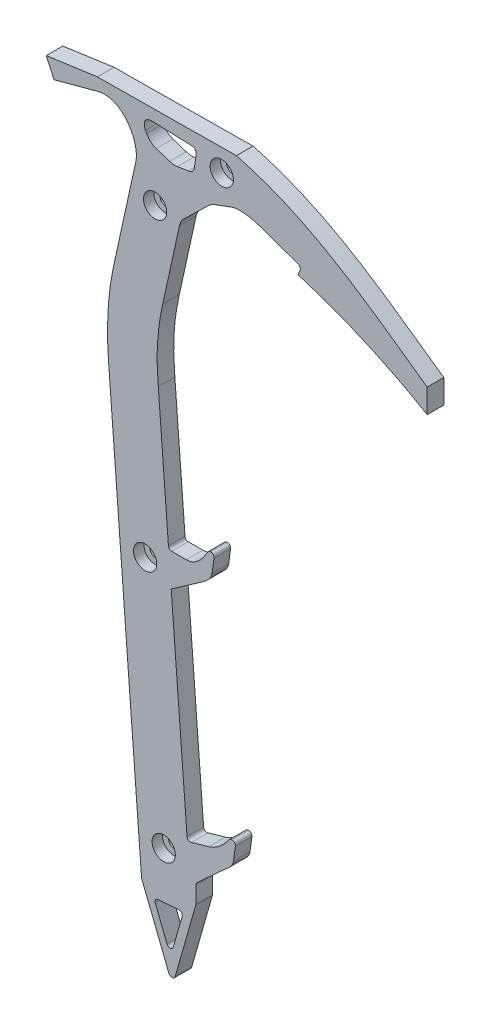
from build123d import *

# Parameters (mm, degrees)
BOSS_EXTRUDE1_DEPTH                                  = 12.7
FILLET1_R                                            = 2.54
CUT_EXTRUDE2_DEPTH                                   = 461.131533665
CUT_EXTRUDE2_DEPTH_BACK                              = 461.131533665
BOSS_EXTRUDE2_DEPTH                                  = 12.7
FILLET2_R                                            = 12.7
CBORE_FOR_5_16_BINDING_HEAD_MACHINE_SCRE_D           = 8.4328
CBORE_FOR_5_16_BINDING_HEAD_MACHINE_SCRE_CBORE_D     = 17.78
CBORE_FOR_5_16_BINDING_HEAD_MACHINE_SCRE_CBORE_DEPTH = 7.9375


with BuildPart() as part:
    # Sketch2 → Boss-Extrude1 (new body)
    with BuildSketch(Plane.XY):
        with BuildLine():
            Line((-24.381519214, 54.99437995), (6.683618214, -350.216574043))
            Line((6.683618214, -350.216574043), (30.344648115, -409.633291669))
            Line((30.344648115, -409.633291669), (48.164661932, -347.036466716))
            Line((48.164661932, -347.036466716), (48.164661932, -332.698935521))
            Line((48.164661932, -332.698935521), (69.074652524, -313.547154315))
            add(Edge.make_bspline(
                [(76.966360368, -303.659842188), (76.35046024, -308.232220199), (72.184299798, -310.698980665), (69.074652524, -313.547154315)],
                knots=[0, 0, 0, 0, 1, 1, 1, 1], degree=3))
            Line((76.966360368, -303.659842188), (78.782448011, -290.177397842))
            Line((78.782448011, -290.177397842), (74.335791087, -290.177397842))
            add(Edge.make_bspline(
                [(74.335791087, -290.177397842), (66.934957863, -301.027986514), (58.01686648, -303.581901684)],
                knots=[0, 0, 0, 1, 1, 1], degree=2))
            Line((58.01686648, -303.581901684), (41.678906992, -308.26067888))
            Line((41.678906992, -308.26067888), (29.333329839, -147.226042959))
            Line((29.333329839, -147.226042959), (52.755727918, -130.901673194))
            add(Edge.make_bspline(
                [(60.647435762, -121.014361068), (60.031535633, -125.586739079), (56.215263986, -128.490530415), (52.755727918, -130.901673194)],
                knots=[0, 0, 0, 0, 1, 1, 1, 1], degree=3))
            Line((60.647435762, -121.014361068), (62.463523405, -107.531916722))
            Line((62.463523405, -107.531916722), (58.01686648, -107.531916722))
            add(Edge.make_bspline(
                [(58.01686648, -107.531916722), (50.196524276, -122.077096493), (40.919949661, -122.077096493)],
                knots=[0, 0, 0, 1, 1, 1], degree=2))
            Line((40.919949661, -122.077096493), (27.405308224, -122.077096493))
            Line((27.405308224, -122.077096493), (13.607007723, 57.906736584))
            add(Edge.make_bspline(
                [(17.032953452, 114.24896132), (11.964804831, 91.155831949), (12.168759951, 76.667115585), (13.607007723, 57.906736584)],
                knots=[0, 0, 0, 0, 1, 1, 1, 1], degree=3))
            Line((17.032953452, 114.24896132), (33.367484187, 188.677605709))
            add(Edge.make_bspline(
                [(33.367484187, 188.677605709), (33.899739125, 191.102836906), (36.146756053, 192.340586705), (38.192170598, 193.098192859)],
                knots=[0, 0, 0, 0, 1, 1, 1, 1], degree=3))
            Line((38.192170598, 193.098192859), (70.085762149, 204.911339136))
            add(Edge.make_bspline(
                [(70.085762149, 204.911339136), (74.268627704, 206.460641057), (83.723559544, 205.582408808), (90.006443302, 203.373136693)],
                knots=[0, 0, 0, 0, 1, 1, 1, 1], degree=3))
            Line((90.006443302, 203.373136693), (123.180174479, 191.708143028))
            Line((123.180174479, 191.708143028), (120.443490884, 185.463663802))
            add(Edge.make_bspline(
                [(219.315189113, 142.132499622), (171.677494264, 170.127728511), (120.443490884, 185.463663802)],
                knots=[0, 0, 0, 1, 1, 1], degree=2))
            Line((219.315189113, 142.132499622), (219.315189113, 160.422302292))
            add(Edge.make_bspline(
                [(219.315189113, 160.422302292), (171.735920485, 194.082892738), (130.178449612, 225.964616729), (73.415353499, 240.7485989)],
                knots=[0, 0, 0, 0, 1, 1, 1, 1], degree=3))
            Line((73.415353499, 240.7485989), (-33.000104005, 239.774233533))
            Line((-33.000104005, 239.774233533), (-72.087681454, 234.290783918))
            Line((-72.087681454, 234.290783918), (-66.119763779, 221.276409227))
            Line((-66.119763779, 221.276409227), (-33.000104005, 230.193837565))
            add(Edge.make_bspline(
                [(-33.000104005, 230.193837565), (-27.13666736, 231.772560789), (-14.986765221, 229.420511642), (-4.288211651, 214.563912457), (-2.529081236, 202.849258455), (-3.595864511, 197.988437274)],
                knots=[0, 0, 0, 0, 0.318927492, 0.707775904, 1, 1, 1, 1], degree=3))
            Line((-3.595864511, 197.988437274), (-20.611000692, 120.458599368))
            add(Edge.make_bspline(
                [(-24.381519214, 54.99437995), (-26.15460413, 78.122345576), (-25.103627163, 99.987849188), (-20.611000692, 120.458599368)],
                knots=[0, 0, 0, 0, 1, 1, 1, 1], degree=3))
        make_face()
        with BuildLine():
            Line((9.964083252, 231.351414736), (39.214695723, 230.193837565))
            add(Edge.make_bspline(
                [(39.214695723, 230.193837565), (41.861982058, 230.089072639), (42.833111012, 228.148273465), (42.601608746, 226.476312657)],
                knots=[0, 0, 0, 0, 1, 1, 1, 1], degree=3))
            Line((42.601608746, 226.476312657), (41.216053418, 216.46952418))
            add(Edge.make_bspline(
                [(36.546218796, 212.210224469), (39.435581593, 212.651197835), (40.927093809, 214.382593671), (41.216053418, 216.46952418)],
                knots=[0, 0, 0, 0, 1, 1, 1, 1], degree=3))
            Line((36.546218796, 212.210224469), (14.018115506, 208.771994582))
            add(Edge.make_bspline(
                [(10.323301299, 210.106233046), (10.912672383, 208.936920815), (12.145186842, 208.486148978), (14.018115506, 208.771994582)],
                knots=[0, 0, 0, 0, 1, 1, 1, 1], degree=3))
            Line((10.323301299, 210.106233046), (3.908693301, 222.832815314))
            add(Edge.make_bspline(
                [(3.908693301, 222.832815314), (2.340645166, 225.943822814), (1.853713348, 231.672378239), (9.964083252, 231.351414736)],
                knots=[0, 0, 0, 0, 1, 1, 1, 1], degree=3))
        make_face(mode=Mode.SUBTRACT)
        Polygon((15.906915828, -358.22479), (38.696088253, -356.477678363), (28.905993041, -390.867599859), align=None, mode=Mode.SUBTRACT)
    extrude(amount=BOSS_EXTRUDE1_DEPTH)

    # Fillet1
    fillet1_edges = [part.edges().sort_by_distance(p)[0] for p in [
        (123.180174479, 191.708143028, 6.35),
        (-33.000104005, 239.774233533, 6.35),
        (6.683618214, -350.216574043, 6.35),
        (30.344648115, -409.633291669, 6.35),
        (48.164661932, -347.036466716, 6.35),
        (48.164661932, -332.698935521, 6.35),
        (41.678906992, -308.26067888, 6.35),
        (74.335791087, -290.177397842, 6.35),
        (78.782448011, -290.177397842, 6.35),
        (27.405308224, -122.077096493, 6.35),
        (58.01686648, -107.531916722, 6.35),
        (62.463523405, -107.531916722, 6.35),
        (28.905993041, -390.867599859, 6.35),
        (15.906915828, -358.22479, 6.35),
        (38.696088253, -356.477678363, 6.35),
    ]]
    fillet(fillet1_edges, radius=FILLET1_R)

    # Sketch7 → Cut-Extrude2 (cut, two sides: drawn at the far end of the back side and taken through both)
    with BuildSketch(Plane.XY.offset(12.7).offset(-CUT_EXTRUDE2_DEPTH_BACK)):
        Polygon((-21.77570053, 21.004307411), (-15.950987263, -54.972746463), (22.037539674, -52.060389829), (16.212826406, 23.916664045), align=None)
    extrude(amount=CUT_EXTRUDE2_DEPTH + CUT_EXTRUDE2_DEPTH_BACK, mode=Mode.SUBTRACT)


with BuildPart() as cut_extrude2_piece_1:
    # of the separate pieces the step leaves, piece 1, a body of its own (cut_extrude2_pieces)
    add(part.part.solids().sort_by_distance((-24.381519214, 54.99437995, 0))[0])


with BuildPart() as cut_extrude2_piece_2:
    # of the separate pieces the step leaves, piece 2, a body of its own (cut_extrude2_pieces)
    add(part.part.solids().sort_by_distance((-15.950987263, -54.972746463, 0))[0])


with BuildPart() as cut_extrude2_piece_1_1:
    # Body-Move_Copy1: moved
    add(cut_extrude2_piece_1.part.moved(Location((5.824713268, -75.977053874, 0))))

    # Combine1: union Cut-Extrude2 piece 2
    add(cut_extrude2_piece_2.part)

    # Sketch8 → Boss-Extrude2 (add)
    with BuildSketch(Plane.XY.offset(12.7)):
        with BuildLine():
            Line((31.106880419, 134.514055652), (12.940710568, 140.492470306))
            Line((12.940710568, 140.492470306), (16.148014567, 134.129179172))
            add(Edge.make_bspline(
                [(16.148014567, 134.129179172), (16.737385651, 132.959866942), (17.96990011, 132.509095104), (19.842828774, 132.794940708)],
                knots=[0, 0, 0, 0, 1, 1, 1, 1], degree=3))
            Line((19.842828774, 132.794940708), (31.106880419, 134.514055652))
        make_face()
        with BuildLine():
            Line((36.469775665, 100.295777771), (59.963679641, 123.027712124))
            Line((59.963679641, 123.027712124), (44.016883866, 117.121138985))
            add(Edge.make_bspline(
                [(39.192197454, 112.700551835), (39.724452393, 115.125783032), (41.97146932, 116.363532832), (44.016883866, 117.121138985)],
                knots=[0, 0, 0, 0, 1, 1, 1, 1], degree=3))
            Line((39.192197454, 112.700551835), (36.469775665, 100.295777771))
        make_face()
    extrude(amount=-BOSS_EXTRUDE2_DEPTH)

    # Fillet2
    fillet2_edges = [cut_extrude2_piece_1_1.edges().sort_by_distance(p)[0] for p in [
        (31.106880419, 134.514055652, 6.35),
        (12.940710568, 140.492470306, 6.35),
        (59.963679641, 123.027712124, 6.35),
        (36.469775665, 100.295777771, 6.35),
    ]]
    fillet(fillet2_edges, radius=FILLET2_R)

    # CBORE for 5_16 Binding Head Machine Scre (through all)
    with Locations(Plane.XY.offset(12.7)):
        with Locations((68.009242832, 147.741681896), (17.04154454, 100.638187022), (9.381929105, -136.197405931), (23.611541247, -321.807230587)):
            CounterBoreHole(CBORE_FOR_5_16_BINDING_HEAD_MACHINE_SCRE_D / 2, CBORE_FOR_5_16_BINDING_HEAD_MACHINE_SCRE_CBORE_D / 2, CBORE_FOR_5_16_BINDING_HEAD_MACHINE_SCRE_CBORE_DEPTH)


solid = cut_extrude2_piece_1_1.part
